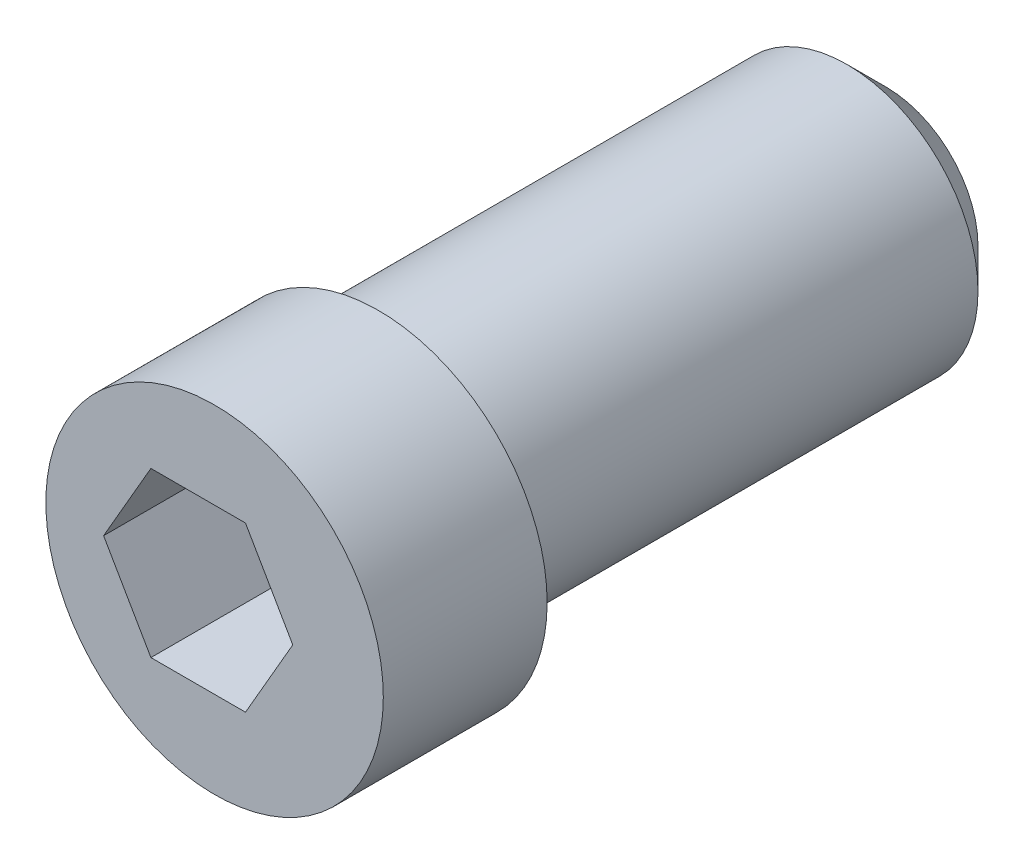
ISO-10303-21;
HEADER;
FILE_DESCRIPTION(('STEP AP214'),'2;1');
FILE_NAME('part.step','',(''),(''),'','','');
FILE_SCHEMA(('AUTOMOTIVE_DESIGN { 1 0 10303 214 1 1 1 1 }'));
ENDSEC;
DATA;
#1=APPLICATION_CONTEXT('core data for automotive mechanical design processes');
#2=APPLICATION_PROTOCOL_DEFINITION('international standard','automotive_design',2000,#1);
#3=PRODUCT_CONTEXT('',#1,'mechanical');
#4=PRODUCT('Part','Part','',(#3));
#5=PRODUCT_RELATED_PRODUCT_CATEGORY('part','',(#4));
#6=PRODUCT_DEFINITION_FORMATION('','',#4);
#7=PRODUCT_DEFINITION_CONTEXT('part definition',#1,'design');
#8=PRODUCT_DEFINITION('design','',#6,#7);
#9=PRODUCT_DEFINITION_SHAPE('','',#8);
#10=(LENGTH_UNIT() NAMED_UNIT(*) SI_UNIT(.MILLI.,.METRE.));
#11=(NAMED_UNIT(*) PLANE_ANGLE_UNIT() SI_UNIT($,.RADIAN.));
#12=(NAMED_UNIT(*) SI_UNIT($,.STERADIAN.) SOLID_ANGLE_UNIT());
#13=UNCERTAINTY_MEASURE_WITH_UNIT(LENGTH_MEASURE(1.E-05),#10,'distance_accuracy_value','');
#14=(GEOMETRIC_REPRESENTATION_CONTEXT(3) GLOBAL_UNCERTAINTY_ASSIGNED_CONTEXT((#13)) GLOBAL_UNIT_ASSIGNED_CONTEXT((#10,
#11,#12)) REPRESENTATION_CONTEXT('',''));
#15=CARTESIAN_POINT('',(0.,0.,0.));
#16=DIRECTION('',(0.,0.,1.));
#17=DIRECTION('',(1.,0.,0.));
#18=AXIS2_PLACEMENT_3D('',#15,#16,#17);
#19=CARTESIAN_POINT('',(-0.00799999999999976,-3.96875,0.));
#20=DIRECTION('',(0.,0.,1.));
#21=DIRECTION('',(-1.,0.,0.));
#22=AXIS2_PLACEMENT_3D('',#19,#20,#21);
#23=PLANE('',#22);
#24=CARTESIAN_POINT('',(0.5,0.,0.));
#25=DIRECTION('',(0.,0.,1.));
#26=DIRECTION('',(1.,0.,0.));
#27=AXIS2_PLACEMENT_3D('',#24,#25,#26);
#28=CIRCLE('',#27,5.15);
#29=CARTESIAN_POINT('',(5.65,0.,0.));
#30=VERTEX_POINT('',#29);
#31=EDGE_CURVE('E124',#30,#30,#28,.T.);
#32=ORIENTED_EDGE('',*,*,#31,.F.);
#33=EDGE_LOOP('',(#32));
#34=FACE_BOUND('',#33,.T.);
#35=CARTESIAN_POINT('',(0.,0.,0.));
#36=DIRECTION('',(0.,0.,1.));
#37=DIRECTION('',(1.,0.,0.));
#38=AXIS2_PLACEMENT_3D('',#35,#36,#37);
#39=CIRCLE('',#38,4.);
#40=CARTESIAN_POINT('',(4.,0.,0.));
#41=VERTEX_POINT('',#40);
#42=EDGE_CURVE('E127',#41,#41,#39,.F.);
#43=ORIENTED_EDGE('',*,*,#42,.F.);
#44=EDGE_LOOP('',(#43));
#45=FACE_BOUND('',#44,.T.);
#46=ADVANCED_FACE('F14',(#34,#45),#23,.F.);
#47=CARTESIAN_POINT('',(0.5,0.,5.));
#48=DIRECTION('',(0.,0.,-1.));
#49=DIRECTION('',(1.,0.,0.));
#50=AXIS2_PLACEMENT_3D('',#47,#48,#49);
#51=PLANE('',#50);
#52=DIRECTION('',(-0.5,0.866025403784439,0.));
#53=VECTOR('',#52,1.);
#54=CARTESIAN_POINT('',(2.88675134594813,0.,5.));
#55=LINE('',#54,#53);
#56=CARTESIAN_POINT('',(2.88675134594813,0.,5.));
#57=VERTEX_POINT('',#56);
#58=CARTESIAN_POINT('',(1.44337567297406,2.5,5.));
#59=VERTEX_POINT('',#58);
#60=EDGE_CURVE('E103',#57,#59,#55,.T.);
#61=ORIENTED_EDGE('',*,*,#60,.F.);
#62=DIRECTION('',(0.5,0.866025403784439,0.));
#63=VECTOR('',#62,1.);
#64=CARTESIAN_POINT('',(1.44337567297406,-2.5,5.));
#65=LINE('',#64,#63);
#66=CARTESIAN_POINT('',(1.44337567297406,-2.5,5.));
#67=VERTEX_POINT('',#66);
#68=EDGE_CURVE('E29',#67,#57,#65,.T.);
#69=ORIENTED_EDGE('',*,*,#68,.F.);
#70=DIRECTION('',(1.,0.,0.));
#71=VECTOR('',#70,1.);
#72=CARTESIAN_POINT('',(-1.44337567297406,-2.5,5.));
#73=LINE('',#72,#71);
#74=CARTESIAN_POINT('',(-1.44337567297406,-2.5,5.));
#75=VERTEX_POINT('',#74);
#76=EDGE_CURVE('E112',#75,#67,#73,.T.);
#77=ORIENTED_EDGE('',*,*,#76,.F.);
#78=DIRECTION('',(0.5,-0.866025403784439,0.));
#79=VECTOR('',#78,1.);
#80=CARTESIAN_POINT('',(-2.88675134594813,0.,5.));
#81=LINE('',#80,#79);
#82=CARTESIAN_POINT('',(-2.88675134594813,0.,5.));
#83=VERTEX_POINT('',#82);
#84=EDGE_CURVE('E110',#83,#75,#81,.T.);
#85=ORIENTED_EDGE('',*,*,#84,.F.);
#86=DIRECTION('',(-0.5,-0.866025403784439,0.));
#87=VECTOR('',#86,1.);
#88=CARTESIAN_POINT('',(-1.44337567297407,2.5,5.));
#89=LINE('',#88,#87);
#90=CARTESIAN_POINT('',(-1.44337567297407,2.5,5.));
#91=VERTEX_POINT('',#90);
#92=EDGE_CURVE('E77',#91,#83,#89,.T.);
#93=ORIENTED_EDGE('',*,*,#92,.F.);
#94=DIRECTION('',(-1.,0.,0.));
#95=VECTOR('',#94,1.);
#96=CARTESIAN_POINT('',(1.44337567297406,2.5,5.));
#97=LINE('',#96,#95);
#98=EDGE_CURVE('E106',#59,#91,#97,.T.);
#99=ORIENTED_EDGE('',*,*,#98,.F.);
#100=EDGE_LOOP('',(#61,#69,#77,#85,#93,#99));
#101=FACE_BOUND('',#100,.T.);
#102=CARTESIAN_POINT('',(0.5,0.,5.));
#103=DIRECTION('',(0.,0.,1.));
#104=DIRECTION('',(1.,0.,0.));
#105=AXIS2_PLACEMENT_3D('',#102,#103,#104);
#106=CIRCLE('',#105,5.15);
#107=CARTESIAN_POINT('',(5.65,0.,5.));
#108=VERTEX_POINT('',#107);
#109=EDGE_CURVE('E116',#108,#108,#106,.T.);
#110=ORIENTED_EDGE('',*,*,#109,.T.);
#111=EDGE_LOOP('',(#110));
#112=FACE_BOUND('',#111,.T.);
#113=ADVANCED_FACE('F149',(#101,#112),#51,.F.);
#114=CARTESIAN_POINT('',(0.5,0.,-11.));
#115=DIRECTION('',(0.,0.,1.));
#116=DIRECTION('',(1.,0.,0.));
#117=AXIS2_PLACEMENT_3D('',#114,#115,#116);
#118=CYLINDRICAL_SURFACE('',#117,5.15);
#119=ORIENTED_EDGE('',*,*,#109,.F.);
#120=EDGE_LOOP('',(#119));
#121=FACE_BOUND('',#120,.T.);
#122=ORIENTED_EDGE('',*,*,#31,.T.);
#123=EDGE_LOOP('',(#122));
#124=FACE_BOUND('',#123,.T.);
#125=ADVANCED_FACE('F155',(#121,#124),#118,.T.);
#126=CARTESIAN_POINT('',(0.,0.,-16.));
#127=DIRECTION('',(0.,0.,1.));
#128=DIRECTION('',(1.,0.,0.));
#129=AXIS2_PLACEMENT_3D('',#126,#127,#128);
#130=CYLINDRICAL_SURFACE('',#129,4.);
#131=CARTESIAN_POINT('',(0.,0.,-14.8));
#132=DIRECTION('',(0.,0.,-1.));
#133=DIRECTION('',(-1.,0.,0.));
#134=AXIS2_PLACEMENT_3D('',#131,#132,#133);
#135=CIRCLE('',#134,4.);
#136=CARTESIAN_POINT('',(-4.,0.,-14.8));
#137=VERTEX_POINT('',#136);
#138=EDGE_CURVE('E9',#137,#137,#135,.F.);
#139=ORIENTED_EDGE('',*,*,#138,.T.);
#140=EDGE_LOOP('',(#139));
#141=FACE_BOUND('',#140,.T.);
#142=ORIENTED_EDGE('',*,*,#42,.T.);
#143=EDGE_LOOP('',(#142));
#144=FACE_BOUND('',#143,.T.);
#145=ADVANCED_FACE('F145',(#141,#144),#130,.T.);
#146=CARTESIAN_POINT('',(0.,0.,-16.));
#147=DIRECTION('',(0.,0.,-1.));
#148=DIRECTION('',(-1.,0.,0.));
#149=AXIS2_PLACEMENT_3D('',#146,#147,#148);
#150=PLANE('',#149);
#151=CARTESIAN_POINT('',(0.,0.,-16.));
#152=DIRECTION('',(0.,0.,-1.));
#153=DIRECTION('',(-1.,0.,0.));
#154=AXIS2_PLACEMENT_3D('',#151,#152,#153);
#155=CIRCLE('',#154,2.8);
#156=CARTESIAN_POINT('',(-2.8,0.,-16.));
#157=VERTEX_POINT('',#156);
#158=EDGE_CURVE('E22',#157,#157,#155,.T.);
#159=ORIENTED_EDGE('',*,*,#158,.T.);
#160=EDGE_LOOP('',(#159));
#161=FACE_BOUND('',#160,.T.);
#162=ADVANCED_FACE('F132',(#161),#150,.T.);
#163=CARTESIAN_POINT('',(0.,0.,-16.));
#164=DIRECTION('',(0.,0.,1.));
#165=DIRECTION('',(1.,0.,0.));
#166=AXIS2_PLACEMENT_3D('',#163,#164,#165);
#167=CONICAL_SURFACE('',#166,2.8,0.785398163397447);
#168=ORIENTED_EDGE('',*,*,#138,.F.);
#169=EDGE_LOOP('',(#168));
#170=FACE_BOUND('',#169,.T.);
#171=ORIENTED_EDGE('',*,*,#158,.F.);
#172=EDGE_LOOP('',(#171));
#173=FACE_BOUND('',#172,.T.);
#174=ADVANCED_FACE('F16',(#170,#173),#167,.T.);
#175=CARTESIAN_POINT('',(1.44337567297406,-2.5,0.5));
#176=DIRECTION('',(0.866025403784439,-0.5,0.));
#177=DIRECTION('',(0.5,0.866025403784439,0.));
#178=AXIS2_PLACEMENT_3D('',#175,#176,#177);
#179=PLANE('',#178);
#180=ORIENTED_EDGE('',*,*,#68,.T.);
#181=DIRECTION('',(0.,0.,1.));
#182=VECTOR('',#181,1.);
#183=CARTESIAN_POINT('',(2.88675134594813,0.,0.5));
#184=LINE('',#183,#182);
#185=CARTESIAN_POINT('',(2.88675134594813,0.,0.5));
#186=VERTEX_POINT('',#185);
#187=EDGE_CURVE('E59',#186,#57,#184,.T.);
#188=ORIENTED_EDGE('',*,*,#187,.F.);
#189=DIRECTION('',(0.5,0.866025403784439,0.));
#190=VECTOR('',#189,1.);
#191=CARTESIAN_POINT('',(1.44337567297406,-2.5,0.5));
#192=LINE('',#191,#190);
#193=CARTESIAN_POINT('',(1.44337567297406,-2.5,0.5));
#194=VERTEX_POINT('',#193);
#195=EDGE_CURVE('E114',#194,#186,#192,.T.);
#196=ORIENTED_EDGE('',*,*,#195,.F.);
#197=DIRECTION('',(0.,0.,1.));
#198=VECTOR('',#197,1.);
#199=CARTESIAN_POINT('',(1.44337567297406,-2.5,0.5));
#200=LINE('',#199,#198);
#201=EDGE_CURVE('E37',#194,#67,#200,.T.);
#202=ORIENTED_EDGE('',*,*,#201,.T.);
#203=EDGE_LOOP('',(#180,#188,#196,#202));
#204=FACE_BOUND('',#203,.T.);
#205=ADVANCED_FACE('F135',(#204),#179,.F.);
#206=CARTESIAN_POINT('',(-1.44337567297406,-2.5,0.5));
#207=DIRECTION('',(0.,-1.,0.));
#208=DIRECTION('',(0.,0.,-1.));
#209=AXIS2_PLACEMENT_3D('',#206,#207,#208);
#210=PLANE('',#209);
#211=ORIENTED_EDGE('',*,*,#76,.T.);
#212=ORIENTED_EDGE('',*,*,#201,.F.);
#213=DIRECTION('',(1.,0.,0.));
#214=VECTOR('',#213,1.);
#215=CARTESIAN_POINT('',(-1.44337567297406,-2.5,0.5));
#216=LINE('',#215,#214);
#217=CARTESIAN_POINT('',(-1.44337567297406,-2.5,0.5));
#218=VERTEX_POINT('',#217);
#219=EDGE_CURVE('E89',#218,#194,#216,.T.);
#220=ORIENTED_EDGE('',*,*,#219,.F.);
#221=DIRECTION('',(0.,0.,1.));
#222=VECTOR('',#221,1.);
#223=CARTESIAN_POINT('',(-1.44337567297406,-2.5,0.5));
#224=LINE('',#223,#222);
#225=EDGE_CURVE('E81',#218,#75,#224,.T.);
#226=ORIENTED_EDGE('',*,*,#225,.T.);
#227=EDGE_LOOP('',(#211,#212,#220,#226));
#228=FACE_BOUND('',#227,.T.);
#229=ADVANCED_FACE('F143',(#228),#210,.F.);
#230=CARTESIAN_POINT('',(-2.88675134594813,0.,0.5));
#231=DIRECTION('',(-0.866025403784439,-0.5,0.));
#232=DIRECTION('',(0.5,-0.866025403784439,0.));
#233=AXIS2_PLACEMENT_3D('',#230,#231,#232);
#234=PLANE('',#233);
#235=ORIENTED_EDGE('',*,*,#84,.T.);
#236=ORIENTED_EDGE('',*,*,#225,.F.);
#237=DIRECTION('',(0.5,-0.866025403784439,0.));
#238=VECTOR('',#237,1.);
#239=CARTESIAN_POINT('',(-2.88675134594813,0.,0.5));
#240=LINE('',#239,#238);
#241=CARTESIAN_POINT('',(-2.88675134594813,0.,0.5));
#242=VERTEX_POINT('',#241);
#243=EDGE_CURVE('E85',#242,#218,#240,.T.);
#244=ORIENTED_EDGE('',*,*,#243,.F.);
#245=DIRECTION('',(0.,0.,1.));
#246=VECTOR('',#245,1.);
#247=CARTESIAN_POINT('',(-2.88675134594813,0.,0.5));
#248=LINE('',#247,#246);
#249=EDGE_CURVE('E70',#242,#83,#248,.T.);
#250=ORIENTED_EDGE('',*,*,#249,.T.);
#251=EDGE_LOOP('',(#235,#236,#244,#250));
#252=FACE_BOUND('',#251,.T.);
#253=ADVANCED_FACE('F86',(#252),#234,.F.);
#254=CARTESIAN_POINT('',(-1.44337567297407,2.5,0.5));
#255=DIRECTION('',(-0.866025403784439,0.5,0.));
#256=DIRECTION('',(-0.5,-0.866025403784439,0.));
#257=AXIS2_PLACEMENT_3D('',#254,#255,#256);
#258=PLANE('',#257);
#259=ORIENTED_EDGE('',*,*,#92,.T.);
#260=ORIENTED_EDGE('',*,*,#249,.F.);
#261=DIRECTION('',(-0.5,-0.866025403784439,0.));
#262=VECTOR('',#261,1.);
#263=CARTESIAN_POINT('',(-1.44337567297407,2.5,0.5));
#264=LINE('',#263,#262);
#265=CARTESIAN_POINT('',(-1.44337567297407,2.5,0.5));
#266=VERTEX_POINT('',#265);
#267=EDGE_CURVE('E74',#266,#242,#264,.T.);
#268=ORIENTED_EDGE('',*,*,#267,.F.);
#269=DIRECTION('',(0.,0.,1.));
#270=VECTOR('',#269,1.);
#271=CARTESIAN_POINT('',(-1.44337567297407,2.5,0.5));
#272=LINE('',#271,#270);
#273=EDGE_CURVE('E82',#266,#91,#272,.T.);
#274=ORIENTED_EDGE('',*,*,#273,.T.);
#275=EDGE_LOOP('',(#259,#260,#268,#274));
#276=FACE_BOUND('',#275,.T.);
#277=ADVANCED_FACE('F72',(#276),#258,.F.);
#278=CARTESIAN_POINT('',(1.44337567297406,2.5,0.5));
#279=DIRECTION('',(0.,1.,0.));
#280=DIRECTION('',(-1.,0.,0.));
#281=AXIS2_PLACEMENT_3D('',#278,#279,#280);
#282=PLANE('',#281);
#283=ORIENTED_EDGE('',*,*,#98,.T.);
#284=ORIENTED_EDGE('',*,*,#273,.F.);
#285=DIRECTION('',(-1.,0.,0.));
#286=VECTOR('',#285,1.);
#287=CARTESIAN_POINT('',(1.44337567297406,2.5,0.5));
#288=LINE('',#287,#286);
#289=CARTESIAN_POINT('',(1.44337567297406,2.5,0.5));
#290=VERTEX_POINT('',#289);
#291=EDGE_CURVE('E95',#290,#266,#288,.T.);
#292=ORIENTED_EDGE('',*,*,#291,.F.);
#293=DIRECTION('',(0.,0.,1.));
#294=VECTOR('',#293,1.);
#295=CARTESIAN_POINT('',(1.44337567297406,2.5,0.5));
#296=LINE('',#295,#294);
#297=EDGE_CURVE('E119',#290,#59,#296,.T.);
#298=ORIENTED_EDGE('',*,*,#297,.T.);
#299=EDGE_LOOP('',(#283,#284,#292,#298));
#300=FACE_BOUND('',#299,.T.);
#301=ADVANCED_FACE('F170',(#300),#282,.F.);
#302=CARTESIAN_POINT('',(2.88675134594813,0.,0.5));
#303=DIRECTION('',(0.866025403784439,0.5,0.));
#304=DIRECTION('',(-0.5,0.866025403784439,0.));
#305=AXIS2_PLACEMENT_3D('',#302,#303,#304);
#306=PLANE('',#305);
#307=ORIENTED_EDGE('',*,*,#60,.T.);
#308=ORIENTED_EDGE('',*,*,#297,.F.);
#309=DIRECTION('',(-0.5,0.866025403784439,0.));
#310=VECTOR('',#309,1.);
#311=CARTESIAN_POINT('',(2.88675134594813,0.,0.5));
#312=LINE('',#311,#310);
#313=EDGE_CURVE('E97',#186,#290,#312,.T.);
#314=ORIENTED_EDGE('',*,*,#313,.F.);
#315=ORIENTED_EDGE('',*,*,#187,.T.);
#316=EDGE_LOOP('',(#307,#308,#314,#315));
#317=FACE_BOUND('',#316,.T.);
#318=ADVANCED_FACE('F167',(#317),#306,.F.);
#319=CARTESIAN_POINT('',(0.,0.,0.5));
#320=DIRECTION('',(0.,0.,1.));
#321=DIRECTION('',(1.,0.,0.));
#322=AXIS2_PLACEMENT_3D('',#319,#320,#321);
#323=PLANE('',#322);
#324=ORIENTED_EDGE('',*,*,#195,.T.);
#325=ORIENTED_EDGE('',*,*,#313,.T.);
#326=ORIENTED_EDGE('',*,*,#291,.T.);
#327=ORIENTED_EDGE('',*,*,#267,.T.);
#328=ORIENTED_EDGE('',*,*,#243,.T.);
#329=ORIENTED_EDGE('',*,*,#219,.T.);
#330=EDGE_LOOP('',(#324,#325,#326,#327,#328,#329));
#331=FACE_BOUND('',#330,.T.);
#332=ADVANCED_FACE('F92',(#331),#323,.T.);
#333=CLOSED_SHELL('',(#46,#113,#125,#145,#162,#174,#205,#229,#253,#277,#301,#318,#332));
#334=MANIFOLD_SOLID_BREP('B1',#333);
#335=ADVANCED_BREP_SHAPE_REPRESENTATION('',(#18,#334),#14);
#336=SHAPE_DEFINITION_REPRESENTATION(#9,#335);
ENDSEC;
END-ISO-10303-21;
